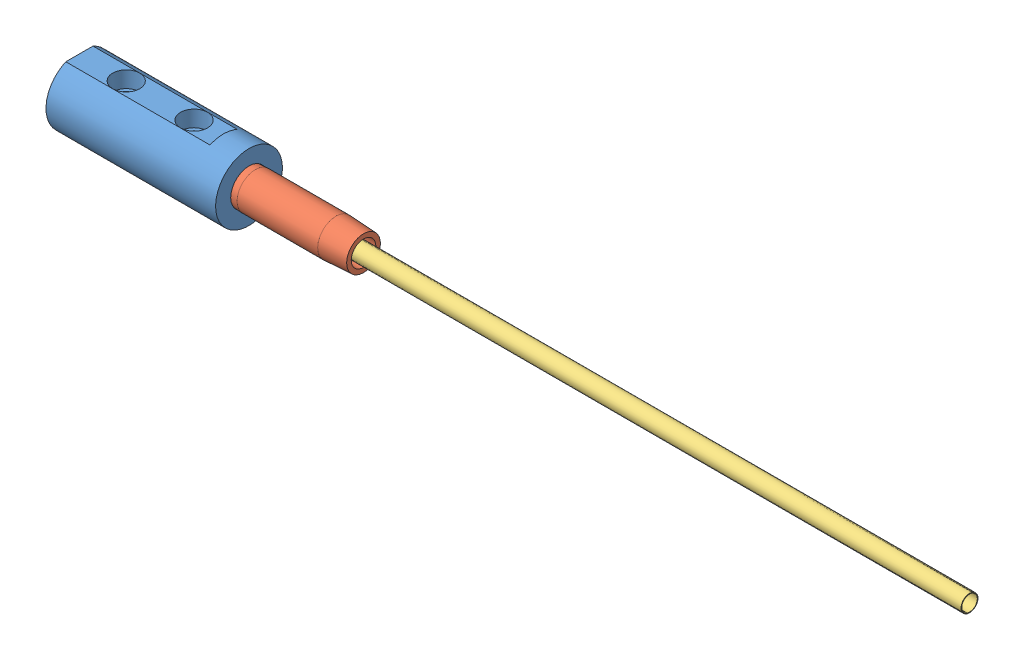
SolidWorks assembly HKC14181.sldasm, configuration Default (file format 11000). Lengths in mm.
Overall size (333.25 25.02 25.02).
3 component instances, 3 part files, 2 mates.
Components (placement in the parent):
- HKCH14181-1: HKCH14181.sldprt [Default] at (0 -12.5095 0) x (1 0 0) z (0 1 0) size (63.5 25.02 25.02)
- GPN25L2-1: GPN25L2.sldprt [Default] at (55.5752 0 0) x (1 0 0) z (0 0.031336 0.999509) size (50.8 13.72 13.72)
- HFT250L12-1: HFT250L12.SLDPRT [Default] at (28.448 0 0) x (0 0.838566 -0.5448) z (0 -0.5448 -0.838566) size (7.92 304.8 7.92)
Mates (geometry in assembly coordinates):
- ProfileCenter1: profile center: plane of HKCH14181-1 through (28.448 -2.921 0) normal (1 0 0); circle of HFT250L12-1
- ProfileCenter2: profile center: plane of GPN25L2-1 through (55.5752 -0.198 -6.3144) normal (-1 0 0); plane of HKCH14181-1 through (55.5752 -6.4427 0) normal (1 0 0)
